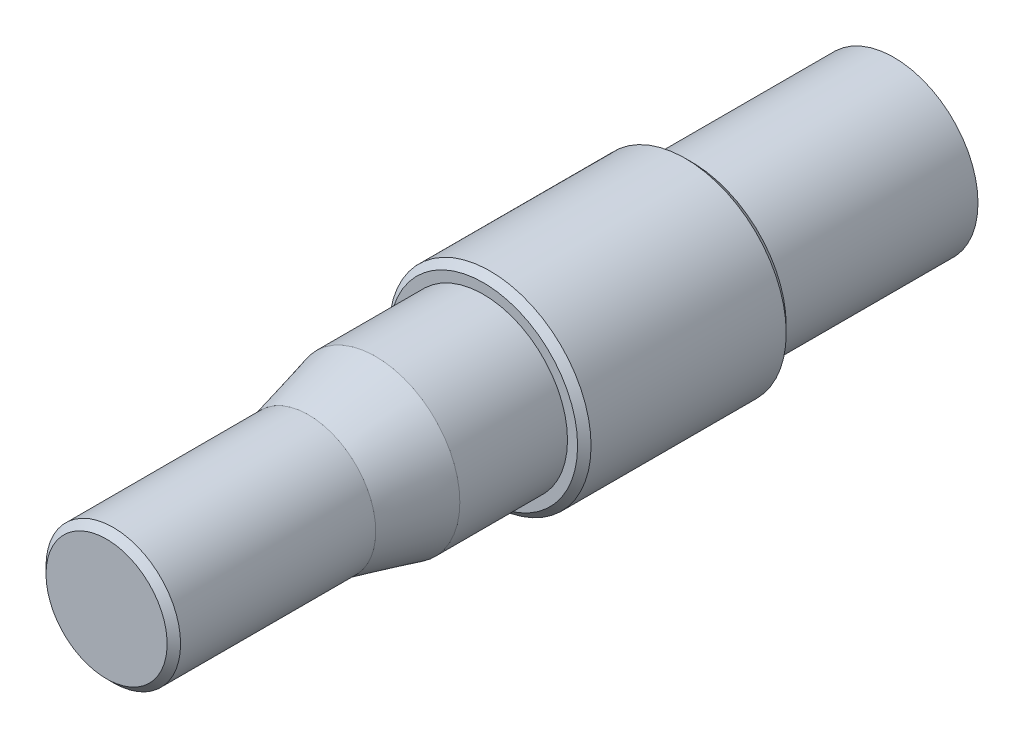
from build123d import *

# Parameters (mm, degrees)
ESQUISSE1_R      = 12.5
EXTRUSION1_DEPTH = 30
ESQUISSE2_R      = 15
EXTRUSION2_DEPTH = 31
CHANFREIN1_SIZE  = 1
EXTRUSION3_START = 16
ESQUISSE3_R      = 12.5
EXTRUSION3_DEPTH = 16
CHANFREIN2_SIZE  = 1


with BuildPart() as part:
    # Esquisse1 → Extrusion1 (new body)
    with BuildSketch(Plane.XY):
        Circle(ESQUISSE1_R)
    extrude(amount=-EXTRUSION1_DEPTH)

    # Esquisse2 → Extrusion2 (add)
    with BuildSketch(Plane.XY):
        Circle(ESQUISSE2_R)
    extrude(amount=EXTRUSION2_DEPTH)

    # Chanfrein1
    chanfrein1_edges = [part.edges().sort_by_distance(p)[0] for p in [
        (-15, 0, 0),
        (-15, 0, 31),
    ]]
    chamfer(chanfrein1_edges, length=CHANFREIN1_SIZE)

    # Esquisse3 → Extrusion3 (add)
    with BuildSketch(Plane.XY.offset(31).offset(EXTRUSION3_START)):
        Circle(ESQUISSE3_R)
    extrude(amount=-EXTRUSION3_DEPTH)

    # Esquisse4 → R_volution1 (revolve)
    with BuildSketch(Plane(origin=(0, 0, 0), x_dir=(0, 0, -1), z_dir=(1, 0, 0)), mode=Mode.PRIVATE) as r_volution1_sk:
        Polygon((-47, 12.5), (-57, 10), (-87, 10), (-87, 0), (-47, 0), align=None)
    revolve(r_volution1_sk.sketch.rotate(Axis((0, 0, 47), (0, 0, -1)), 90), axis=Axis((0, 0, 47), (0, 0, -1)))

    # Chanfrein2
    chanfrein2_edges = [part.edges().sort_by_distance(p)[0] for p in [
        (-10, 0, 87),
    ]]
    chamfer(chanfrein2_edges, length=CHANFREIN2_SIZE)


solid = part.part
